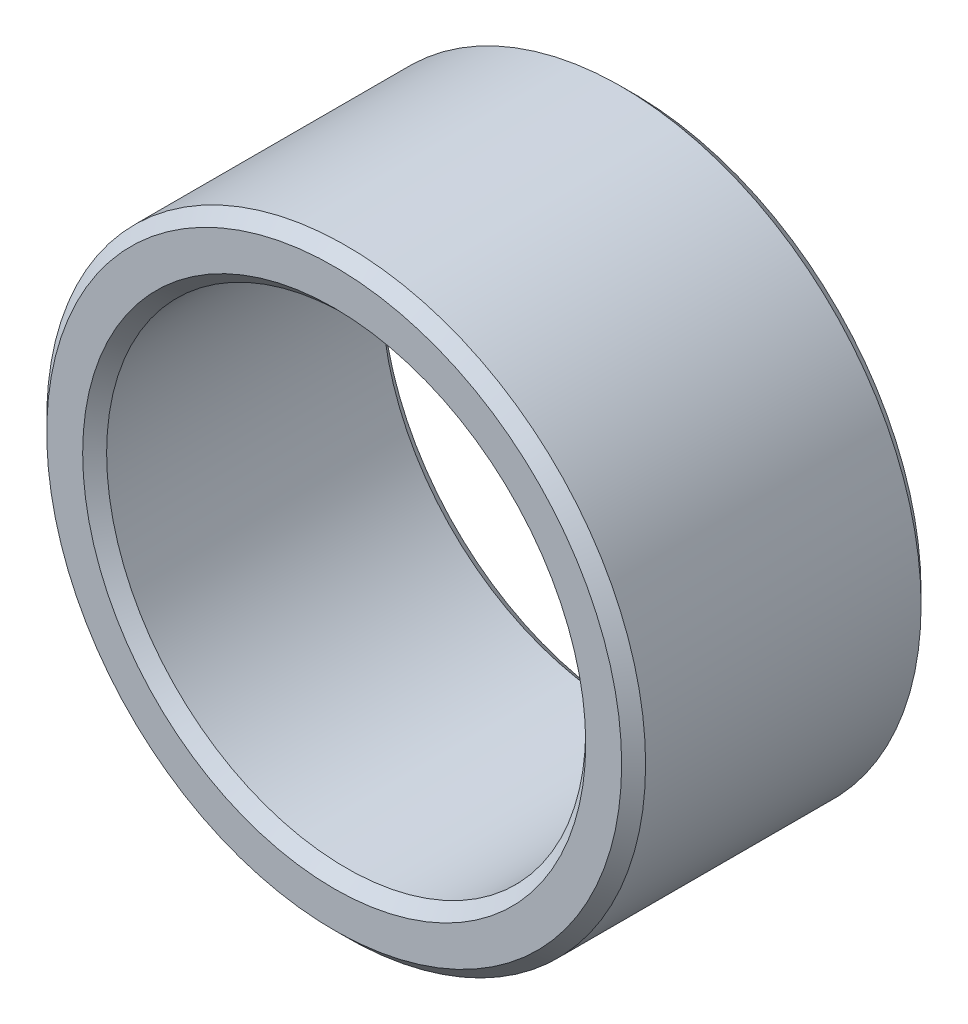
from build123d import *

# Parameters (mm, degrees)
ESQUISSE1_R      = 25
ESQUISSE1_R_2    = 20
EXTRUSION1_DEPTH = 25
CHANFREIN1_SIZE  = 1


with BuildPart() as part:
    # Esquisse1 → Extrusion1 (new body)
    with BuildSketch(Plane.XY):
        Circle(ESQUISSE1_R)
        Circle(ESQUISSE1_R_2, mode=Mode.SUBTRACT)
    extrude(amount=EXTRUSION1_DEPTH)

    # Chanfrein1
    chanfrein1_edges = [part.edges().sort_by_distance(p)[0] for p in [
        (-25, 0, 0),
        (-25, 0, 25),
        (-20, 0, 0),
        (-20, 0, 25),
    ]]
    chamfer(chanfrein1_edges, length=CHANFREIN1_SIZE)


solid = part.part
